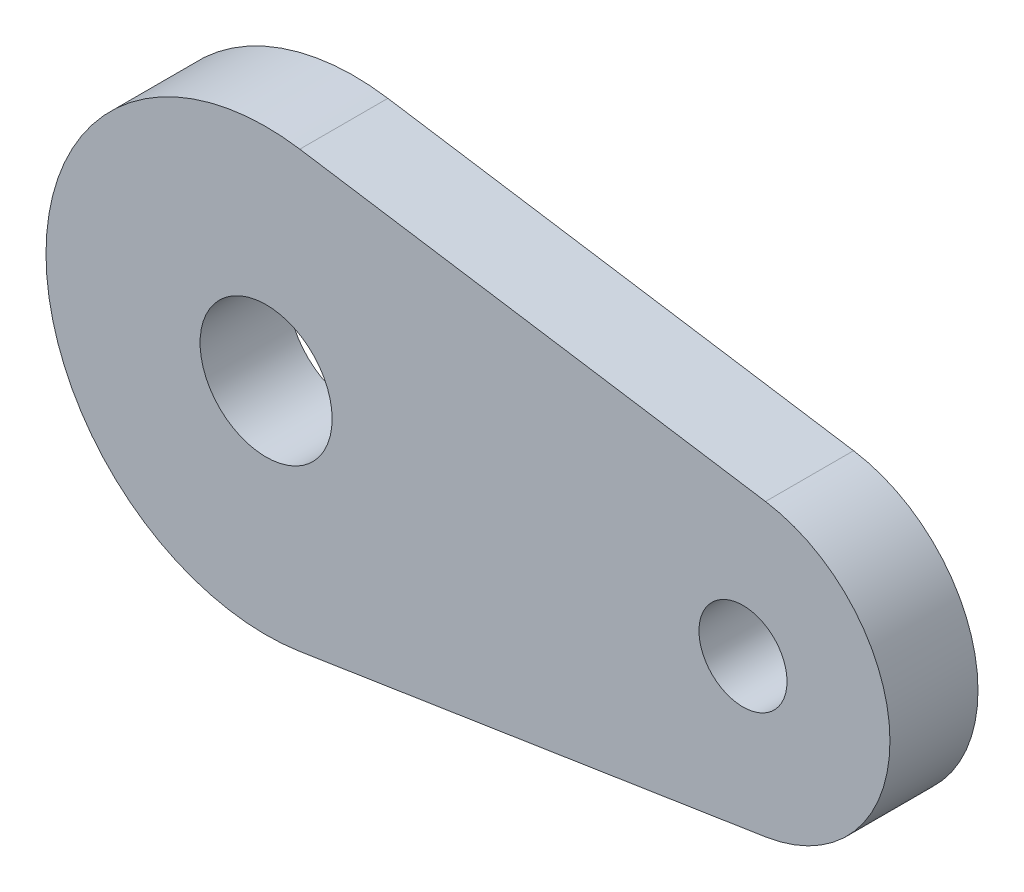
from build123d import *

# Parameters (mm, degrees)
SKETCH_1_R      = 9
SKETCH_1_R_2    = 6
EXTRUDE_1_DEPTH = 12


with BuildPart() as part:
    # Sketch 1 → Extrude 1 (new body)
    with BuildSketch(Plane.XY):
        with BuildLine():
            Line((4.596272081, 29.645809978), (68.072129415, 19.794068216))
            ThreePointArc((68.072129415, 19.794068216), (85.031053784, 0), (68.072129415, -19.794068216))
            Line((68.072129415, -19.794068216), (4.596272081, -29.645809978))
            ThreePointArc((4.596272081, -29.645809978), (-29.999996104, 0), (4.596272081, 29.645809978))
        make_face()
        Circle(SKETCH_1_R, mode=Mode.SUBTRACT)
        with Locations((65, 0)):
            Circle(SKETCH_1_R_2, mode=Mode.SUBTRACT)
    extrude(amount=EXTRUDE_1_DEPTH)


solid = part.part
